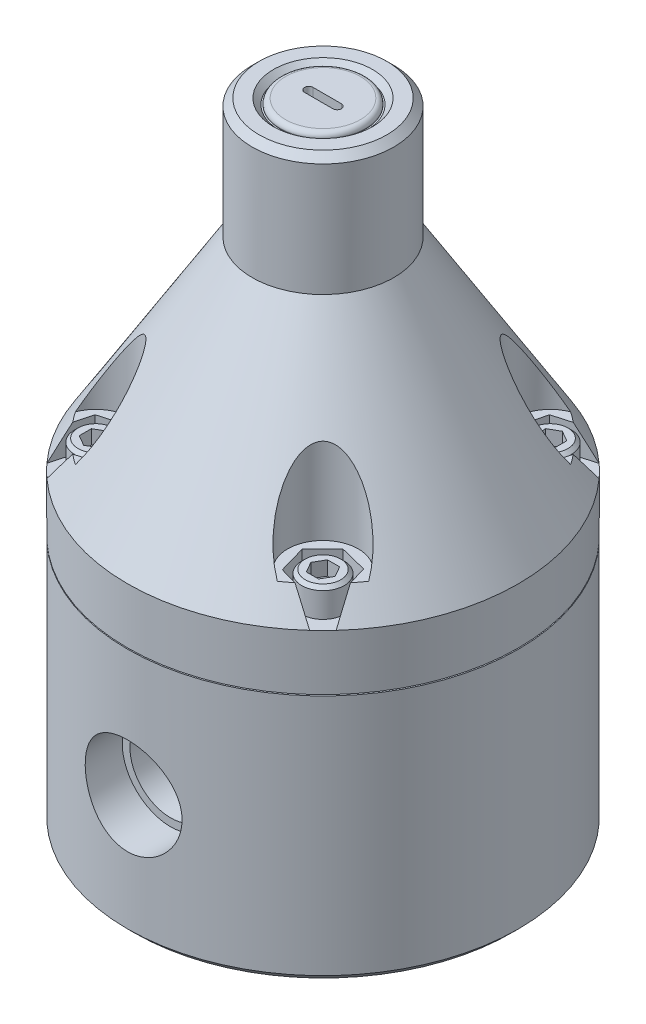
from build123d import *

# Parameters (mm, degrees)
SKETCH1_R         = 43.815
EXTRUDE1_DEPTH    = 140.97
SKETCH3_R         = 11.1125
EXTRUDE2_DEPTH    = 1.27
EXTRUDE2_DRAFT    = -45
CHAMFER1_SIZE     = 1.5748
SKETCH4_R         = 9.525
EXTRUDE3_DEPTH    = 1.27
FILLET1_R         = 1.143
EXTRUDE4_DEPTH    = 3.302
EXTRUDE4_DRAFT    = -1
SKETCH6_R         = 7.9375
EXTRUDE5_DEPTH    = 22.86
EXTRUDE6_DEPTH    = 6.35
CIRPATTERN1_COUNT = 4
SKETCH9_R         = 4.7625
EXTRUDE7_DEPTH    = 6.35
EXTRUDE8_DEPTH    = 3.175
CIRPATTERN2_COUNT = 4
CHAMFER2_SIZE     = 0.762


with BuildPart() as part:
    # Sketch1 → Extrude1 (new body)
    with BuildSketch(Plane(origin=(0, 0, 0), x_dir=(1, 0, 0), z_dir=(0, 1, 0))):
        with Locations(Location((0, 0, 0), (0, 0, 270))):
            Circle(SKETCH1_R)
    extrude(amount=EXTRUDE1_DEPTH)

    # Sketch2 → Cut-Revolve1 (revolve, cut)
    with BuildSketch(Plane.XY, mode=Mode.PRIVATE) as cut_revolve1_sk:
        Polygon((-43.815, 56.134), (-43.815, 68.58), (-15.875, 114.046), (-15.875, 147.034008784), (-49.44729897, 147.034008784), (-49.44729897, 55.88), (-30.226, 55.88), (-30.226, 56.134), align=None)
    revolve(cut_revolve1_sk.sketch.rotate(Axis((0, 0, 0), (0, 1, 0)), 270), axis=Axis((0, 0, 0), (0, 1, 0)), mode=Mode.SUBTRACT)


with BuildPart() as extrude2_tool:
    # Sketch3 → Extrude2 (with draft: the straight prism first)
    with BuildSketch(Plane(origin=(0, 140.97, 0), x_dir=(-1, 0, 0), z_dir=(0, 1, 0))):
        Circle(SKETCH3_R)
    extrude(amount=-EXTRUDE2_DEPTH)
    # Extrude2: the draft: its side faces are tilted about the plane it starts from
    extrude2_sides = [extrude2_tool.faces().sort_by_distance(p)[0] for p in [
        (11.1125, 140.335, 0),
    ]]
    draft(extrude2_sides, Plane(origin=(0, 140.97, 0), x_dir=(-1, 0, 0), z_dir=(0, 1, 0)), EXTRUDE2_DRAFT)


with BuildPart() as part_1:
    add(part.part)

    # Extrude2: cut by extrude2_tool
    add(extrude2_tool.part, mode=Mode.SUBTRACT)

    # Chamfer1
    chamfer1_edges = [part_1.edges().sort_by_distance(p)[0] for p in [
        (0, 0, -43.815),
        (0, 140.97, 15.875),
    ]]
    chamfer(chamfer1_edges, length=CHAMFER1_SIZE)

    # Sketch4 → Extrude3 (add)
    with BuildSketch(Plane(origin=(0, 140.97, 0), x_dir=(-1, 0, 0), z_dir=(0, 1, 0))):
        with Locations(Location((0, 0, 0), (0, 0, 90))):
            Circle(SKETCH4_R)
    extrude(amount=-EXTRUDE3_DEPTH)

    # Fillet1
    fillet1_edges = [part_1.edges().sort_by_distance(p)[0] for p in [
        (0, 140.97, -9.525),
    ]]
    fillet(fillet1_edges, radius=FILLET1_R)


with BuildPart() as extrude4_tool:
    # Sketch5 → Extrude4 (with draft: the straight prism first)
    with BuildSketch(Plane(origin=(0, 140.97, 0), x_dir=(-1, 0, 0), z_dir=(0, 1, 0))):
        with BuildLine():
            Line((3.175, 0.9652), (-3.175, 0.9652))
            ThreePointArc((-3.175, 0.9652), (-4.1402, 0), (-3.175, -0.9652))
            Line((-3.175, -0.9652), (3.175, -0.9652))
            ThreePointArc((3.175, -0.9652), (4.1402, 0), (3.175, 0.9652))
        make_face()
    extrude(amount=-EXTRUDE4_DEPTH)
    # Extrude4: the draft: its side faces are tilted about the plane it starts from
    extrude4_sides = [extrude4_tool.faces().sort_by_distance(p)[0] for p in [
        (-4.1402, 139.319, 0),
        (0, 139.319, 0.9652),
        (4.1402, 139.319, 0),
        (0, 139.319, -0.9652),
    ]]
    draft(extrude4_sides, Plane(origin=(0, 140.97, 0), x_dir=(-1, 0, 0), z_dir=(0, 1, 0)), EXTRUDE4_DRAFT)


with BuildPart() as part_2:
    add(part_1.part)

    # Extrude4: cut by extrude4_tool
    add(extrude4_tool.part, mode=Mode.SUBTRACT)

    # Sketch6 → Extrude5 (cut)
    with BuildSketch(Plane(origin=(0, 74.93, 0), x_dir=(-1, 0, 0), z_dir=(0, 1, 0))):
        with Locations((-25.459026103, 25.459026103)):
            Circle(SKETCH6_R)
    extrude5 = extrude(amount=EXTRUDE5_DEPTH, mode=Mode.SUBTRACT)

    # Sketch8 → Extrude6 (cut)
    with BuildSketch(Plane(origin=(0, 74.93, 0), x_dir=(-1, 0, 0), z_dir=(0, 1, 0))):
        Polygon((-29.948607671, 20.824591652), (-23.690278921, 19.253717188), (-19.200697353, 23.888151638), (-20.969444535, 30.093460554), (-33.591654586, 33.591654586), align=None)
    extrude6 = extrude(amount=-EXTRUDE6_DEPTH, mode=Mode.SUBTRACT)

    # CirPattern1: Extrude5, Extrude6 ×4 about axis
    cirpattern1_axis = Axis((0, 0, 0), (0, 1, 0))
    add([extrude5.rotate(cirpattern1_axis, i * 360 / CIRPATTERN1_COUNT) for i in range(1, CIRPATTERN1_COUNT)], mode=Mode.SUBTRACT)
    add([extrude6.rotate(cirpattern1_axis, i * 360 / CIRPATTERN1_COUNT) for i in range(1, CIRPATTERN1_COUNT)], mode=Mode.SUBTRACT)

    # Sketch9 → Extrude7 (add)
    with BuildSketch(Plane(origin=(0, 74.93, 0), x_dir=(-1, 0, 0), z_dir=(0, 1, 0))):
        with Locations(Location((-25.459026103, 25.459026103, 0), (0, 0, 90))):
            Circle(SKETCH9_R)
    extrude7 = extrude(amount=-EXTRUDE7_DEPTH)

    # Sketch10 → Extrude8 (cut)
    with BuildSketch(Plane(origin=(0, 74.93, 0), x_dir=(-1, 0, 0), z_dir=(0, 1, 0))):
        Polygon((-28.187127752, 25.459026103), (-26.823076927, 23.096420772), (-24.094975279, 23.096420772), (-22.730924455, 25.459026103), (-24.094975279, 27.821631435), (-26.823076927, 27.821631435), align=None)
    extrude8 = extrude(amount=-EXTRUDE8_DEPTH, mode=Mode.SUBTRACT)

    # CirPattern2: Extrude7, Extrude8 ×4 about axis
    cirpattern2_axis = Axis((0, 0, 0), (0, 1, 0))
    add([extrude7.rotate(cirpattern2_axis, i * 360 / CIRPATTERN2_COUNT) for i in range(1, CIRPATTERN2_COUNT)])
    add([extrude8.rotate(cirpattern2_axis, i * 360 / CIRPATTERN2_COUNT) for i in range(1, CIRPATTERN2_COUNT)], mode=Mode.SUBTRACT)

    # Chamfer2
    chamfer2_edges = [part_2.edges().sort_by_distance(p)[0] for p in [
        (25.459026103, 74.93, 20.696526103),
        (-20.696526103, 74.93, 25.459026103),
        (-25.459026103, 74.93, -20.696526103),
        (20.696526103, 74.93, -25.459026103),
    ]]
    chamfer(chamfer2_edges, length=CHAMFER2_SIZE)

    # Sketch14 → CBORE for _00 Binding Head Machine Screw (revolve, cut)
    with BuildSketch(Plane(origin=(0, 27.432, 43.815), x_dir=(0, -1, 0), z_dir=(1, 0, 0))):
        Polygon((0, 0), (0, 23.596366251), (9.1186, 19.05), (9.1186, 9.652), (10.8585, 9.652), (10.8585, 0), align=None)
    cbore_for_00_binding_head_machine_screw = revolve(axis=Axis((0, 27.432, 50.165), (0, 0, -1)), mode=Mode.SUBTRACT)

    # Mirror1: CBORE for _00 Binding Head Machine Screw across plane
    add(cbore_for_00_binding_head_machine_screw.mirror(Plane.XY), mode=Mode.SUBTRACT)


solid = part_2.part
